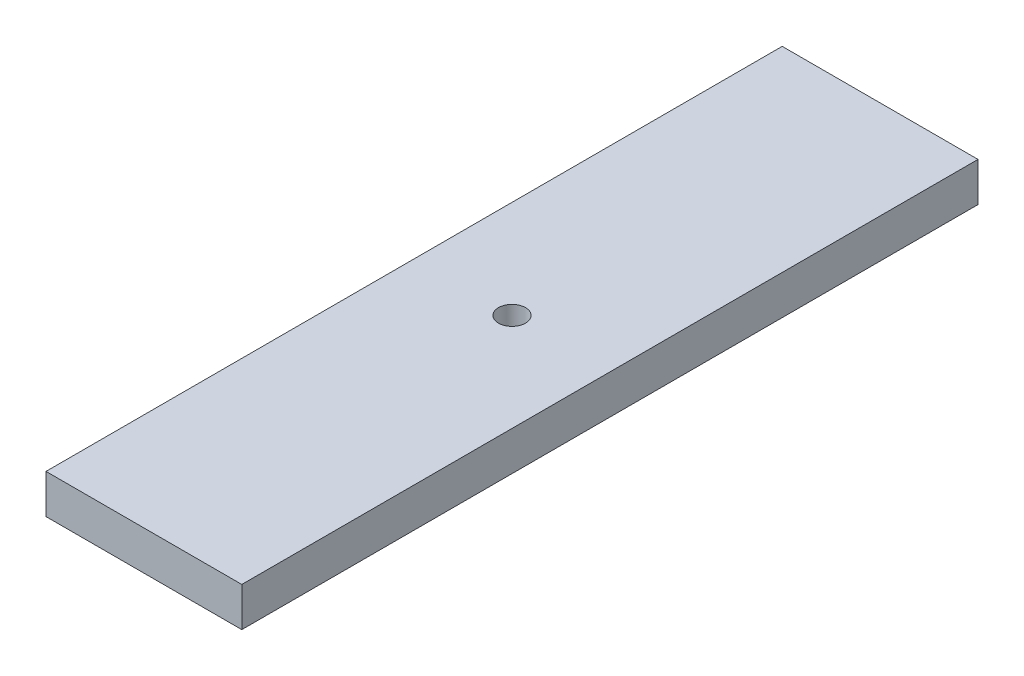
from build123d import *

# Parameters (mm, degrees)
ESQUISSE1_W             = 50
ESQUISSE1_H             = 10
BASE_EXTRUSION_DEPTH    = 94
ESQUISSE2_R             = 3.45
ENL_V_MAT_EXTRU_1_DEPTH = 98.780366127


with BuildPart() as part:
    # Esquisse1 → Base-Extrusion (new, symmetric)
    with BuildSketch(Plane.XY):
        Rectangle(ESQUISSE1_W, ESQUISSE1_H)
    extrude(amount=BASE_EXTRUSION_DEPTH, both=True)

    # Esquisse2 → Enl_v. mat.-Extru.1 (cut, through all)
    with BuildSketch(Plane(origin=(0, 5, 0), x_dir=(-1, 0, 0), z_dir=(0, 1, 0))):
        Circle(ESQUISSE2_R)
    extrude(amount=-ENL_V_MAT_EXTRU_1_DEPTH, mode=Mode.SUBTRACT)


solid = part.part
